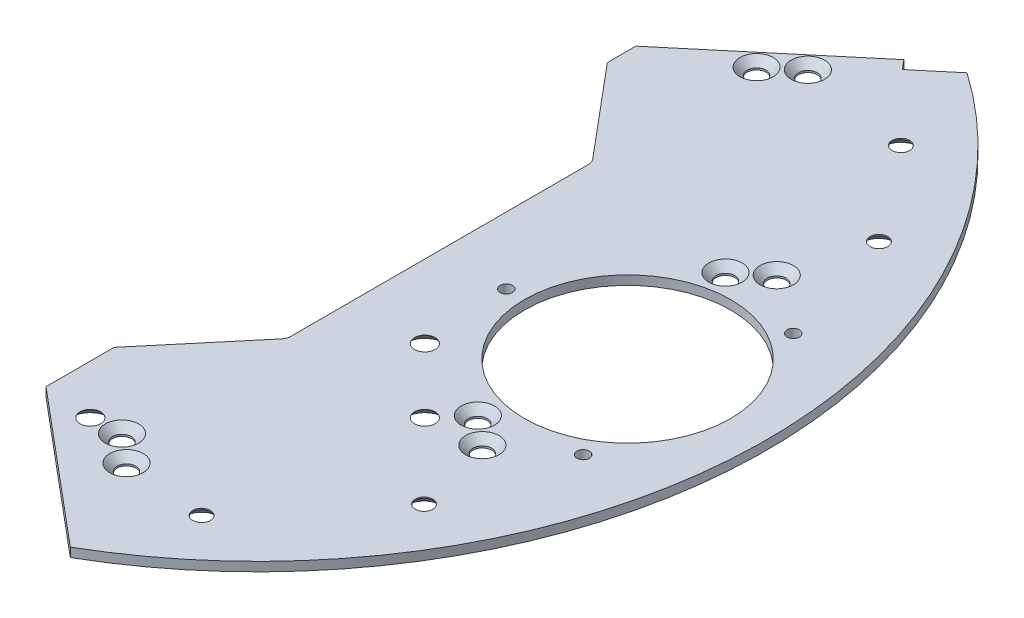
ISO-10303-21;
HEADER;
FILE_DESCRIPTION(('STEP AP214'),'2;1');
FILE_NAME('part.step','',(''),(''),'','','');
FILE_SCHEMA(('AUTOMOTIVE_DESIGN { 1 0 10303 214 1 1 1 1 }'));
ENDSEC;
DATA;
#1=APPLICATION_CONTEXT('core data for automotive mechanical design processes');
#2=APPLICATION_PROTOCOL_DEFINITION('international standard','automotive_design',2000,#1);
#3=PRODUCT_CONTEXT('',#1,'mechanical');
#4=PRODUCT('Part','Part','',(#3));
#5=PRODUCT_RELATED_PRODUCT_CATEGORY('part','',(#4));
#6=PRODUCT_DEFINITION_FORMATION('','',#4);
#7=PRODUCT_DEFINITION_CONTEXT('part definition',#1,'design');
#8=PRODUCT_DEFINITION('design','',#6,#7);
#9=PRODUCT_DEFINITION_SHAPE('','',#8);
#10=(LENGTH_UNIT() NAMED_UNIT(*) SI_UNIT(.MILLI.,.METRE.));
#11=(NAMED_UNIT(*) PLANE_ANGLE_UNIT() SI_UNIT($,.RADIAN.));
#12=(NAMED_UNIT(*) SI_UNIT($,.STERADIAN.) SOLID_ANGLE_UNIT());
#13=UNCERTAINTY_MEASURE_WITH_UNIT(LENGTH_MEASURE(1.E-05),#10,'distance_accuracy_value','');
#14=(GEOMETRIC_REPRESENTATION_CONTEXT(3) GLOBAL_UNCERTAINTY_ASSIGNED_CONTEXT((#13)) GLOBAL_UNIT_ASSIGNED_CONTEXT((#10,
#11,#12)) REPRESENTATION_CONTEXT('',''));
#15=CARTESIAN_POINT('',(0.,0.,0.));
#16=DIRECTION('',(0.,0.,1.));
#17=DIRECTION('',(1.,0.,0.));
#18=AXIS2_PLACEMENT_3D('',#15,#16,#17);
#19=CARTESIAN_POINT('',(17.,1.5,85.3229160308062));
#20=DIRECTION('',(-1.,0.,0.));
#21=DIRECTION('',(0.,0.,1.));
#22=AXIS2_PLACEMENT_3D('',#19,#20,#21);
#23=PLANE('',#22);
#24=DIRECTION('',(0.,1.,0.));
#25=VECTOR('',#24,1.);
#26=CARTESIAN_POINT('',(17.,0.,51.8930588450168));
#27=LINE('',#26,#25);
#28=CARTESIAN_POINT('',(17.,0.,51.8930588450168));
#29=VERTEX_POINT('',#28);
#30=CARTESIAN_POINT('',(17.,1.5,51.8930588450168));
#31=VERTEX_POINT('',#30);
#32=EDGE_CURVE('E155',#29,#31,#27,.T.);
#33=ORIENTED_EDGE('',*,*,#32,.T.);
#34=DIRECTION('',(0.,0.,-1.));
#35=VECTOR('',#34,1.);
#36=CARTESIAN_POINT('',(17.,1.5,85.3229160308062));
#37=LINE('',#36,#35);
#38=CARTESIAN_POINT('',(17.,1.5,40.6657856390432));
#39=VERTEX_POINT('',#38);
#40=EDGE_CURVE('E337',#31,#39,#37,.T.);
#41=ORIENTED_EDGE('',*,*,#40,.T.);
#42=DIRECTION('',(0.,1.,0.));
#43=VECTOR('',#42,1.);
#44=CARTESIAN_POINT('',(17.,-1.,40.6657856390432));
#45=LINE('',#44,#43);
#46=CARTESIAN_POINT('',(17.,0.,40.6657856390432));
#47=VERTEX_POINT('',#46);
#48=EDGE_CURVE('E305',#47,#39,#45,.T.);
#49=ORIENTED_EDGE('',*,*,#48,.F.);
#50=DIRECTION('',(0.,0.,-1.));
#51=VECTOR('',#50,1.);
#52=CARTESIAN_POINT('',(17.,0.,85.3229160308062));
#53=LINE('',#52,#51);
#54=EDGE_CURVE('E341',#29,#47,#53,.T.);
#55=ORIENTED_EDGE('',*,*,#54,.F.);
#56=EDGE_LOOP('',(#33,#41,#49,#55));
#57=FACE_BOUND('',#56,.T.);
#58=ADVANCED_FACE('F40',(#57),#23,.T.);
#59=DIRECTION('',(0.,-1.,0.));
#60=VECTOR('',#59,1.);
#61=CARTESIAN_POINT('',(17.,1.5,-45.3660223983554));
#62=LINE('',#61,#60);
#63=CARTESIAN_POINT('',(17.,1.5,-45.3660223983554));
#64=VERTEX_POINT('',#63);
#65=CARTESIAN_POINT('',(17.,0.,-45.3660223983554));
#66=VERTEX_POINT('',#65);
#67=EDGE_CURVE('E157',#64,#66,#62,.T.);
#68=ORIENTED_EDGE('',*,*,#67,.T.);
#69=CARTESIAN_POINT('',(17.,0.,-40.6657856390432));
#70=VERTEX_POINT('',#69);
#71=EDGE_CURVE('E154',#70,#66,#53,.T.);
#72=ORIENTED_EDGE('',*,*,#71,.F.);
#73=DIRECTION('',(0.,1.,0.));
#74=VECTOR('',#73,1.);
#75=CARTESIAN_POINT('',(17.,-1.,-40.6657856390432));
#76=LINE('',#75,#74);
#77=CARTESIAN_POINT('',(17.,1.5,-40.6657856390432));
#78=VERTEX_POINT('',#77);
#79=EDGE_CURVE('E308',#70,#78,#76,.T.);
#80=ORIENTED_EDGE('',*,*,#79,.T.);
#81=EDGE_CURVE('E340',#78,#64,#37,.T.);
#82=ORIENTED_EDGE('',*,*,#81,.T.);
#83=EDGE_LOOP('',(#68,#72,#80,#82));
#84=FACE_BOUND('',#83,.T.);
#85=ADVANCED_FACE('F42',(#84),#23,.T.);
#86=CARTESIAN_POINT('',(0.,1.5,0.));
#87=DIRECTION('',(0.,1.,0.));
#88=DIRECTION('',(0.,0.,1.));
#89=AXIS2_PLACEMENT_3D('',#86,#87,#88);
#90=PLANE('',#89);
#91=DIRECTION('',(0.766044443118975,0.,-0.642787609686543));
#92=VECTOR('',#91,1.);
#93=CARTESIAN_POINT('',(42.3140472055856,1.5,-63.9962154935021));
#94=LINE('',#93,#92);
#95=CARTESIAN_POINT('',(42.3140472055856,1.5,-63.9962154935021));
#96=VERTEX_POINT('',#95);
#97=CARTESIAN_POINT('',(48.108978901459,1.5,-68.858740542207));
#98=VERTEX_POINT('',#97);
#99=EDGE_CURVE('E55',#96,#98,#94,.T.);
#100=ORIENTED_EDGE('',*,*,#99,.F.);
#101=DIRECTION('',(0.642787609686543,0.,0.766044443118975));
#102=VECTOR('',#101,1.);
#103=CARTESIAN_POINT('',(41.0284719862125,1.5,-65.52830437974));
#104=LINE('',#103,#102);
#105=CARTESIAN_POINT('',(41.0284719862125,1.5,-65.52830437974));
#106=VERTEX_POINT('',#105);
#107=EDGE_CURVE('E460',#106,#96,#104,.T.);
#108=ORIENTED_EDGE('',*,*,#107,.F.);
#109=DIRECTION('',(-0.766044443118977,0.,0.642787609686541));
#110=VECTOR('',#109,1.);
#111=CARTESIAN_POINT('',(28.0276438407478,1.5,-54.6193142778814));
#112=LINE('',#111,#110);
#113=EDGE_CURVE('E147',#106,#64,#112,.T.);
#114=ORIENTED_EDGE('',*,*,#113,.T.);
#115=ORIENTED_EDGE('',*,*,#81,.F.);
#116=DIRECTION('',(-0.642787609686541,0.,-0.766044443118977));
#117=VECTOR('',#116,1.);
#118=CARTESIAN_POINT('',(29.5320888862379,1.5,-25.7306236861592));
#119=LINE('',#118,#117);
#120=CARTESIAN_POINT('',(29.5320888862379,1.5,-25.7306236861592));
#121=VERTEX_POINT('',#120);
#122=EDGE_CURVE('E291',#121,#78,#119,.T.);
#123=ORIENTED_EDGE('',*,*,#122,.F.);
#124=CARTESIAN_POINT('',(28.,1.5,-24.4450484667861));
#125=DIRECTION('',(0.,1.,0.));
#126=DIRECTION('',(0.,0.,1.));
#127=AXIS2_PLACEMENT_3D('',#124,#125,#126);
#128=CIRCLE('',#127,2.);
#129=CARTESIAN_POINT('',(30.,1.5,-24.4450484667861));
#130=VERTEX_POINT('',#129);
#131=EDGE_CURVE('E288',#130,#121,#128,.T.);
#132=ORIENTED_EDGE('',*,*,#131,.F.);
#133=DIRECTION('',(0.,0.,-1.));
#134=VECTOR('',#133,1.);
#135=CARTESIAN_POINT('',(30.,1.5,0.));
#136=LINE('',#135,#134);
#137=CARTESIAN_POINT('',(30.,1.5,24.4450484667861));
#138=VERTEX_POINT('',#137);
#139=EDGE_CURVE('E285',#138,#130,#136,.T.);
#140=ORIENTED_EDGE('',*,*,#139,.F.);
#141=CARTESIAN_POINT('',(28.,1.5,24.4450484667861));
#142=DIRECTION('',(0.,1.,0.));
#143=DIRECTION('',(0.,0.,-1.));
#144=AXIS2_PLACEMENT_3D('',#141,#142,#143);
#145=CIRCLE('',#144,2.);
#146=CARTESIAN_POINT('',(29.532088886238,1.5,25.7306236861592));
#147=VERTEX_POINT('',#146);
#148=EDGE_CURVE('E296',#147,#138,#145,.T.);
#149=ORIENTED_EDGE('',*,*,#148,.F.);
#150=DIRECTION('',(0.64278760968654,0.,-0.766044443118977));
#151=VECTOR('',#150,1.);
#152=CARTESIAN_POINT('',(29.532088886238,1.5,25.7306236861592));
#153=LINE('',#152,#151);
#154=EDGE_CURVE('E293',#39,#147,#153,.T.);
#155=ORIENTED_EDGE('',*,*,#154,.F.);
#156=ORIENTED_EDGE('',*,*,#40,.F.);
#157=DIRECTION('',(-0.766044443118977,0.,-0.642787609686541));
#158=VECTOR('',#157,1.);
#159=CARTESIAN_POINT('',(24.8137057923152,1.5,58.4495364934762));
#160=LINE('',#159,#158);
#161=CARTESIAN_POINT('',(41.9121137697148,1.5,72.796804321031));
#162=VERTEX_POINT('',#161);
#163=EDGE_CURVE('E160',#162,#31,#160,.T.);
#164=ORIENTED_EDGE('',*,*,#163,.F.);
#165=CARTESIAN_POINT('',(0.,1.5,0.));
#166=DIRECTION('',(0.,-1.,0.));
#167=DIRECTION('',(0.,0.,-1.));
#168=AXIS2_PLACEMENT_3D('',#165,#166,#167);
#169=CIRCLE('',#168,84.);
#170=EDGE_CURVE('E62',#98,#162,#169,.T.);
#171=ORIENTED_EDGE('',*,*,#170,.F.);
#172=EDGE_LOOP('',(#100,#108,#114,#115,#123,#132,#140,#149,#155,#156,#164,#171));
#173=FACE_BOUND('',#172,.T.);
#174=CARTESIAN_POINT('',(42.0728534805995,1.5,14.4956890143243));
#175=DIRECTION('',(0.,1.,0.));
#176=DIRECTION('',(0.,0.,1.));
#177=AXIS2_PLACEMENT_3D('',#174,#175,#176);
#178=CIRCLE('',#177,1.7);
#179=CARTESIAN_POINT('',(42.0728534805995,1.5,16.1956890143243));
#180=VERTEX_POINT('',#179);
#181=EDGE_CURVE('E170',#180,#180,#178,.T.);
#182=ORIENTED_EDGE('',*,*,#181,.F.);
#183=EDGE_LOOP('',(#182));
#184=FACE_BOUND('',#183,.T.);
#185=CARTESIAN_POINT('',(52.6794551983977,1.5,25.1022907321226));
#186=DIRECTION('',(0.,1.,0.));
#187=DIRECTION('',(0.,0.,1.));
#188=AXIS2_PLACEMENT_3D('',#185,#186,#187);
#189=CIRCLE('',#188,1.7);
#190=CARTESIAN_POINT('',(52.6794551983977,1.5,26.8022907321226));
#191=VERTEX_POINT('',#190);
#192=EDGE_CURVE('E177',#191,#191,#189,.T.);
#193=ORIENTED_EDGE('',*,*,#192,.F.);
#194=EDGE_LOOP('',(#193));
#195=FACE_BOUND('',#194,.T.);
#196=CARTESIAN_POINT('',(25.1022907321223,1.5,52.6794551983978));
#197=DIRECTION('',(0.,1.,0.));
#198=DIRECTION('',(0.,0.,1.));
#199=AXIS2_PLACEMENT_3D('',#196,#197,#198);
#200=CIRCLE('',#199,1.7);
#201=CARTESIAN_POINT('',(25.1022907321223,1.5,54.3794551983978));
#202=VERTEX_POINT('',#201);
#203=EDGE_CURVE('E184',#202,#202,#200,.T.);
#204=ORIENTED_EDGE('',*,*,#203,.F.);
#205=EDGE_LOOP('',(#204));
#206=FACE_BOUND('',#205,.T.);
#207=CARTESIAN_POINT('',(48.2090707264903,1.5,57.4533332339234));
#208=DIRECTION('',(0.,1.,0.));
#209=DIRECTION('',(0.,0.,1.));
#210=AXIS2_PLACEMENT_3D('',#207,#208,#209);
#211=CIRCLE('',#210,1.44999999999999);
#212=CARTESIAN_POINT('',(48.2090707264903,1.5,58.9033332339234));
#213=VERTEX_POINT('',#212);
#214=EDGE_CURVE('E191',#213,#213,#211,.T.);
#215=ORIENTED_EDGE('',*,*,#214,.F.);
#216=EDGE_LOOP('',(#215));
#217=FACE_BOUND('',#216,.T.);
#218=CARTESIAN_POINT('',(64.9519052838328,1.5,37.5000000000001));
#219=DIRECTION('',(0.,1.,0.));
#220=DIRECTION('',(0.,0.,1.));
#221=AXIS2_PLACEMENT_3D('',#218,#219,#220);
#222=CIRCLE('',#221,1.44999999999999);
#223=CARTESIAN_POINT('',(64.9519052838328,1.5,38.9500000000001));
#224=VERTEX_POINT('',#223);
#225=EDGE_CURVE('E198',#224,#224,#222,.T.);
#226=ORIENTED_EDGE('',*,*,#225,.F.);
#227=EDGE_LOOP('',(#226));
#228=FACE_BOUND('',#227,.T.);
#229=CARTESIAN_POINT('',(64.9519052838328,1.5,-37.5000000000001));
#230=DIRECTION('',(0.,1.,0.));
#231=DIRECTION('',(0.,0.,1.));
#232=AXIS2_PLACEMENT_3D('',#229,#230,#231);
#233=CIRCLE('',#232,1.44999999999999);
#234=CARTESIAN_POINT('',(64.9519052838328,1.5,-36.0500000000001));
#235=VERTEX_POINT('',#234);
#236=EDGE_CURVE('E205',#235,#235,#233,.T.);
#237=ORIENTED_EDGE('',*,*,#236,.F.);
#238=EDGE_LOOP('',(#237));
#239=FACE_BOUND('',#238,.T.);
#240=CARTESIAN_POINT('',(53.033008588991,1.5,-53.0330085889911));
#241=DIRECTION('',(0.,1.,0.));
#242=DIRECTION('',(0.,0.,1.));
#243=AXIS2_PLACEMENT_3D('',#240,#241,#242);
#244=CIRCLE('',#243,1.44999999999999);
#245=CARTESIAN_POINT('',(53.033008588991,1.5,-51.5830085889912));
#246=VERTEX_POINT('',#245);
#247=EDGE_CURVE('E212',#246,#246,#244,.T.);
#248=ORIENTED_EDGE('',*,*,#247,.F.);
#249=EDGE_LOOP('',(#248));
#250=FACE_BOUND('',#249,.T.);
#251=CARTESIAN_POINT('',(56.7281106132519,1.5,20.415429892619));
#252=DIRECTION('',(0.,1.,0.));
#253=DIRECTION('',(0.,0.,1.));
#254=AXIS2_PLACEMENT_3D('',#251,#252,#253);
#255=CIRCLE('',#254,2.75);
#256=CARTESIAN_POINT('',(56.7281106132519,1.5,23.165429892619));
#257=VERTEX_POINT('',#256);
#258=EDGE_CURVE('E213',#257,#257,#255,.T.);
#259=ORIENTED_EDGE('',*,*,#258,.F.);
#260=EDGE_LOOP('',(#259));
#261=FACE_BOUND('',#260,.T.);
#262=CARTESIAN_POINT('',(61.3243772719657,1.5,24.2721555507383));
#263=DIRECTION('',(0.,1.,0.));
#264=DIRECTION('',(0.,0.,1.));
#265=AXIS2_PLACEMENT_3D('',#262,#263,#264);
#266=CIRCLE('',#265,2.75);
#267=CARTESIAN_POINT('',(61.3243772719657,1.5,27.0221555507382));
#268=VERTEX_POINT('',#267);
#269=EDGE_CURVE('E222',#268,#268,#266,.T.);
#270=ORIENTED_EDGE('',*,*,#269,.F.);
#271=EDGE_LOOP('',(#270));
#272=FACE_BOUND('',#271,.T.);
#273=CARTESIAN_POINT('',(29.9560066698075,1.5,52.3211809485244));
#274=DIRECTION('',(0.,1.,0.));
#275=DIRECTION('',(0.,0.,1.));
#276=AXIS2_PLACEMENT_3D('',#273,#274,#275);
#277=CIRCLE('',#276,2.75);
#278=CARTESIAN_POINT('',(29.9560066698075,1.5,55.0711809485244));
#279=VERTEX_POINT('',#278);
#280=EDGE_CURVE('E231',#279,#279,#277,.T.);
#281=ORIENTED_EDGE('',*,*,#280,.F.);
#282=EDGE_LOOP('',(#281));
#283=FACE_BOUND('',#282,.T.);
#284=CARTESIAN_POINT('',(34.5522733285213,1.5,56.1779066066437));
#285=DIRECTION('',(0.,1.,0.));
#286=DIRECTION('',(0.,0.,1.));
#287=AXIS2_PLACEMENT_3D('',#284,#285,#286);
#288=CIRCLE('',#287,2.75);
#289=CARTESIAN_POINT('',(34.5522733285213,1.5,58.9279066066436));
#290=VERTEX_POINT('',#289);
#291=EDGE_CURVE('E240',#290,#290,#288,.T.);
#292=ORIENTED_EDGE('',*,*,#291,.F.);
#293=EDGE_LOOP('',(#292));
#294=FACE_BOUND('',#293,.T.);
#295=CARTESIAN_POINT('',(34.5522733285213,1.5,-56.1779066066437));
#296=DIRECTION('',(0.,1.,0.));
#297=DIRECTION('',(0.,0.,1.));
#298=AXIS2_PLACEMENT_3D('',#295,#296,#297);
#299=CIRCLE('',#298,2.75);
#300=CARTESIAN_POINT('',(34.5522733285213,1.5,-53.4279066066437));
#301=VERTEX_POINT('',#300);
#302=EDGE_CURVE('E249',#301,#301,#299,.T.);
#303=ORIENTED_EDGE('',*,*,#302,.F.);
#304=EDGE_LOOP('',(#303));
#305=FACE_BOUND('',#304,.T.);
#306=CARTESIAN_POINT('',(29.9560066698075,1.5,-52.3211809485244));
#307=DIRECTION('',(0.,1.,0.));
#308=DIRECTION('',(0.,0.,1.));
#309=AXIS2_PLACEMENT_3D('',#306,#307,#308);
#310=CIRCLE('',#309,2.75);
#311=CARTESIAN_POINT('',(29.9560066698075,1.5,-49.5711809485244));
#312=VERTEX_POINT('',#311);
#313=EDGE_CURVE('E258',#312,#312,#310,.T.);
#314=ORIENTED_EDGE('',*,*,#313,.F.);
#315=EDGE_LOOP('',(#314));
#316=FACE_BOUND('',#315,.T.);
#317=CARTESIAN_POINT('',(61.3243772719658,1.5,-24.2721555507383));
#318=DIRECTION('',(0.,1.,0.));
#319=DIRECTION('',(0.,0.,1.));
#320=AXIS2_PLACEMENT_3D('',#317,#318,#319);
#321=CIRCLE('',#320,2.75);
#322=CARTESIAN_POINT('',(61.3243772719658,1.5,-21.5221555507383));
#323=VERTEX_POINT('',#322);
#324=EDGE_CURVE('E267',#323,#323,#321,.T.);
#325=ORIENTED_EDGE('',*,*,#324,.F.);
#326=EDGE_LOOP('',(#325));
#327=FACE_BOUND('',#326,.T.);
#328=CARTESIAN_POINT('',(56.7281106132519,1.5,-20.4154298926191));
#329=DIRECTION('',(0.,1.,0.));
#330=DIRECTION('',(0.,0.,1.));
#331=AXIS2_PLACEMENT_3D('',#328,#329,#330);
#332=CIRCLE('',#331,2.75);
#333=CARTESIAN_POINT('',(56.7281106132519,1.5,-17.6654298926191));
#334=VERTEX_POINT('',#333);
#335=EDGE_CURVE('E276',#334,#334,#332,.T.);
#336=ORIENTED_EDGE('',*,*,#335,.F.);
#337=EDGE_LOOP('',(#336));
#338=FACE_BOUND('',#337,.T.);
#339=CARTESIAN_POINT('',(71.,1.5,17.3205080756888));
#340=DIRECTION('',(0.,1.,0.));
#341=DIRECTION('',(0.,0.,1.));
#342=AXIS2_PLACEMENT_3D('',#339,#340,#341);
#343=CIRCLE('',#342,1.025);
#344=CARTESIAN_POINT('',(71.,1.5,18.3455080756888));
#345=VERTEX_POINT('',#344);
#346=EDGE_CURVE('E302',#345,#345,#343,.T.);
#347=ORIENTED_EDGE('',*,*,#346,.F.);
#348=EDGE_LOOP('',(#347));
#349=FACE_BOUND('',#348,.T.);
#350=CARTESIAN_POINT('',(41.,1.5,0.));
#351=DIRECTION('',(0.,1.,0.));
#352=DIRECTION('',(0.,0.,1.));
#353=AXIS2_PLACEMENT_3D('',#350,#351,#352);
#354=CIRCLE('',#353,1.025);
#355=CARTESIAN_POINT('',(41.,1.5,1.025));
#356=VERTEX_POINT('',#355);
#357=EDGE_CURVE('E319',#356,#356,#354,.T.);
#358=ORIENTED_EDGE('',*,*,#357,.F.);
#359=EDGE_LOOP('',(#358));
#360=FACE_BOUND('',#359,.T.);
#361=CARTESIAN_POINT('',(71.,1.5,-17.3205080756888));
#362=DIRECTION('',(0.,1.,0.));
#363=DIRECTION('',(0.,0.,1.));
#364=AXIS2_PLACEMENT_3D('',#361,#362,#363);
#365=CIRCLE('',#364,1.025);
#366=CARTESIAN_POINT('',(71.,1.5,-16.2955080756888));
#367=VERTEX_POINT('',#366);
#368=EDGE_CURVE('E325',#367,#367,#365,.T.);
#369=ORIENTED_EDGE('',*,*,#368,.F.);
#370=EDGE_LOOP('',(#369));
#371=FACE_BOUND('',#370,.T.);
#372=CARTESIAN_POINT('',(61.,1.5,0.));
#373=DIRECTION('',(0.,1.,0.));
#374=DIRECTION('',(0.,0.,1.));
#375=AXIS2_PLACEMENT_3D('',#372,#373,#374);
#376=CIRCLE('',#375,17.);
#377=CARTESIAN_POINT('',(61.,1.5,17.));
#378=VERTEX_POINT('',#377);
#379=EDGE_CURVE('E331',#378,#378,#376,.T.);
#380=ORIENTED_EDGE('',*,*,#379,.F.);
#381=EDGE_LOOP('',(#380));
#382=FACE_BOUND('',#381,.T.);
#383=ADVANCED_FACE('F372',(#173,#184,#195,#206,#217,#228,#239,#250,#261,#272,#283,#294,#305,
#316,#327,#338,#349,#360,#371,#382),#90,.T.);
#384=CARTESIAN_POINT('',(0.,0.,0.));
#385=DIRECTION('',(0.,1.,0.));
#386=DIRECTION('',(0.,0.,1.));
#387=AXIS2_PLACEMENT_3D('',#384,#385,#386);
#388=PLANE('',#387);
#389=CARTESIAN_POINT('',(42.0728534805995,0.,14.4956890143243));
#390=DIRECTION('',(0.,-1.,0.));
#391=DIRECTION('',(0.,0.,-1.));
#392=AXIS2_PLACEMENT_3D('',#389,#390,#391);
#393=CIRCLE('',#392,3.15);
#394=CARTESIAN_POINT('',(42.0728534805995,0.,11.3456890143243));
#395=VERTEX_POINT('',#394);
#396=EDGE_CURVE('E164',#395,#395,#393,.T.);
#397=ORIENTED_EDGE('',*,*,#396,.F.);
#398=EDGE_LOOP('',(#397));
#399=FACE_BOUND('',#398,.T.);
#400=CARTESIAN_POINT('',(52.6794551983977,0.,25.1022907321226));
#401=DIRECTION('',(0.,-1.,0.));
#402=DIRECTION('',(0.,0.,-1.));
#403=AXIS2_PLACEMENT_3D('',#400,#401,#402);
#404=CIRCLE('',#403,3.15);
#405=CARTESIAN_POINT('',(52.6794551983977,0.,21.9522907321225));
#406=VERTEX_POINT('',#405);
#407=EDGE_CURVE('E171',#406,#406,#404,.T.);
#408=ORIENTED_EDGE('',*,*,#407,.F.);
#409=EDGE_LOOP('',(#408));
#410=FACE_BOUND('',#409,.T.);
#411=CARTESIAN_POINT('',(25.1022907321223,0.,52.6794551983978));
#412=DIRECTION('',(0.,-1.,0.));
#413=DIRECTION('',(0.,0.,-1.));
#414=AXIS2_PLACEMENT_3D('',#411,#412,#413);
#415=CIRCLE('',#414,3.15);
#416=CARTESIAN_POINT('',(25.1022907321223,0.,49.5294551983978));
#417=VERTEX_POINT('',#416);
#418=EDGE_CURVE('E178',#417,#417,#415,.T.);
#419=ORIENTED_EDGE('',*,*,#418,.F.);
#420=EDGE_LOOP('',(#419));
#421=FACE_BOUND('',#420,.T.);
#422=CARTESIAN_POINT('',(48.2090707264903,0.,57.4533332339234));
#423=DIRECTION('',(0.,-1.,0.));
#424=DIRECTION('',(0.,0.,-1.));
#425=AXIS2_PLACEMENT_3D('',#422,#423,#424);
#426=CIRCLE('',#425,2.75);
#427=CARTESIAN_POINT('',(48.2090707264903,0.,54.7033332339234));
#428=VERTEX_POINT('',#427);
#429=EDGE_CURVE('E185',#428,#428,#426,.T.);
#430=ORIENTED_EDGE('',*,*,#429,.F.);
#431=EDGE_LOOP('',(#430));
#432=FACE_BOUND('',#431,.T.);
#433=CARTESIAN_POINT('',(64.9519052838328,0.,37.5000000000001));
#434=DIRECTION('',(0.,-1.,0.));
#435=DIRECTION('',(0.,0.,-1.));
#436=AXIS2_PLACEMENT_3D('',#433,#434,#435);
#437=CIRCLE('',#436,2.75);
#438=CARTESIAN_POINT('',(64.9519052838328,0.,34.7500000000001));
#439=VERTEX_POINT('',#438);
#440=EDGE_CURVE('E192',#439,#439,#437,.T.);
#441=ORIENTED_EDGE('',*,*,#440,.F.);
#442=EDGE_LOOP('',(#441));
#443=FACE_BOUND('',#442,.T.);
#444=CARTESIAN_POINT('',(64.9519052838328,0.,-37.5000000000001));
#445=DIRECTION('',(0.,-1.,0.));
#446=DIRECTION('',(0.,0.,-1.));
#447=AXIS2_PLACEMENT_3D('',#444,#445,#446);
#448=CIRCLE('',#447,2.75);
#449=CARTESIAN_POINT('',(64.9519052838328,0.,-40.2500000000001));
#450=VERTEX_POINT('',#449);
#451=EDGE_CURVE('E199',#450,#450,#448,.T.);
#452=ORIENTED_EDGE('',*,*,#451,.F.);
#453=EDGE_LOOP('',(#452));
#454=FACE_BOUND('',#453,.T.);
#455=CARTESIAN_POINT('',(53.033008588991,0.,-53.0330085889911));
#456=DIRECTION('',(0.,-1.,0.));
#457=DIRECTION('',(0.,0.,-1.));
#458=AXIS2_PLACEMENT_3D('',#455,#456,#457);
#459=CIRCLE('',#458,2.75);
#460=CARTESIAN_POINT('',(53.033008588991,0.,-55.7830085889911));
#461=VERTEX_POINT('',#460);
#462=EDGE_CURVE('E206',#461,#461,#459,.T.);
#463=ORIENTED_EDGE('',*,*,#462,.F.);
#464=EDGE_LOOP('',(#463));
#465=FACE_BOUND('',#464,.T.);
#466=CARTESIAN_POINT('',(56.7281106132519,0.,20.415429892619));
#467=DIRECTION('',(0.,1.,0.));
#468=DIRECTION('',(0.,0.,1.));
#469=AXIS2_PLACEMENT_3D('',#466,#467,#468);
#470=CIRCLE('',#469,1.55);
#471=CARTESIAN_POINT('',(56.7281106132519,0.,21.965429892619));
#472=VERTEX_POINT('',#471);
#473=EDGE_CURVE('E219',#472,#472,#470,.T.);
#474=ORIENTED_EDGE('',*,*,#473,.T.);
#475=EDGE_LOOP('',(#474));
#476=FACE_BOUND('',#475,.T.);
#477=CARTESIAN_POINT('',(61.3243772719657,0.,24.2721555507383));
#478=DIRECTION('',(0.,1.,0.));
#479=DIRECTION('',(0.,0.,1.));
#480=AXIS2_PLACEMENT_3D('',#477,#478,#479);
#481=CIRCLE('',#480,1.55);
#482=CARTESIAN_POINT('',(61.3243772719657,0.,25.8221555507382));
#483=VERTEX_POINT('',#482);
#484=EDGE_CURVE('E228',#483,#483,#481,.T.);
#485=ORIENTED_EDGE('',*,*,#484,.T.);
#486=EDGE_LOOP('',(#485));
#487=FACE_BOUND('',#486,.T.);
#488=CARTESIAN_POINT('',(29.9560066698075,0.,52.3211809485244));
#489=DIRECTION('',(0.,1.,0.));
#490=DIRECTION('',(0.,0.,1.));
#491=AXIS2_PLACEMENT_3D('',#488,#489,#490);
#492=CIRCLE('',#491,1.55);
#493=CARTESIAN_POINT('',(29.9560066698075,0.,53.8711809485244));
#494=VERTEX_POINT('',#493);
#495=EDGE_CURVE('E237',#494,#494,#492,.T.);
#496=ORIENTED_EDGE('',*,*,#495,.T.);
#497=EDGE_LOOP('',(#496));
#498=FACE_BOUND('',#497,.T.);
#499=CARTESIAN_POINT('',(34.5522733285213,0.,56.1779066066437));
#500=DIRECTION('',(0.,1.,0.));
#501=DIRECTION('',(0.,0.,1.));
#502=AXIS2_PLACEMENT_3D('',#499,#500,#501);
#503=CIRCLE('',#502,1.55);
#504=CARTESIAN_POINT('',(34.5522733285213,0.,57.7279066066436));
#505=VERTEX_POINT('',#504);
#506=EDGE_CURVE('E246',#505,#505,#503,.T.);
#507=ORIENTED_EDGE('',*,*,#506,.T.);
#508=EDGE_LOOP('',(#507));
#509=FACE_BOUND('',#508,.T.);
#510=CARTESIAN_POINT('',(34.5522733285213,0.,-56.1779066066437));
#511=DIRECTION('',(0.,1.,0.));
#512=DIRECTION('',(0.,0.,1.));
#513=AXIS2_PLACEMENT_3D('',#510,#511,#512);
#514=CIRCLE('',#513,1.55);
#515=CARTESIAN_POINT('',(34.5522733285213,0.,-54.6279066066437));
#516=VERTEX_POINT('',#515);
#517=EDGE_CURVE('E255',#516,#516,#514,.T.);
#518=ORIENTED_EDGE('',*,*,#517,.T.);
#519=EDGE_LOOP('',(#518));
#520=FACE_BOUND('',#519,.T.);
#521=CARTESIAN_POINT('',(29.9560066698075,0.,-52.3211809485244));
#522=DIRECTION('',(0.,1.,0.));
#523=DIRECTION('',(0.,0.,1.));
#524=AXIS2_PLACEMENT_3D('',#521,#522,#523);
#525=CIRCLE('',#524,1.55);
#526=CARTESIAN_POINT('',(29.9560066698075,0.,-50.7711809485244));
#527=VERTEX_POINT('',#526);
#528=EDGE_CURVE('E264',#527,#527,#525,.T.);
#529=ORIENTED_EDGE('',*,*,#528,.T.);
#530=EDGE_LOOP('',(#529));
#531=FACE_BOUND('',#530,.T.);
#532=CARTESIAN_POINT('',(61.3243772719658,0.,-24.2721555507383));
#533=DIRECTION('',(0.,1.,0.));
#534=DIRECTION('',(0.,0.,1.));
#535=AXIS2_PLACEMENT_3D('',#532,#533,#534);
#536=CIRCLE('',#535,1.55);
#537=CARTESIAN_POINT('',(61.3243772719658,0.,-22.7221555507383));
#538=VERTEX_POINT('',#537);
#539=EDGE_CURVE('E273',#538,#538,#536,.T.);
#540=ORIENTED_EDGE('',*,*,#539,.T.);
#541=EDGE_LOOP('',(#540));
#542=FACE_BOUND('',#541,.T.);
#543=CARTESIAN_POINT('',(56.7281106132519,0.,-20.4154298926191));
#544=DIRECTION('',(0.,1.,0.));
#545=DIRECTION('',(0.,0.,1.));
#546=AXIS2_PLACEMENT_3D('',#543,#544,#545);
#547=CIRCLE('',#546,1.55);
#548=CARTESIAN_POINT('',(56.7281106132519,0.,-18.8654298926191));
#549=VERTEX_POINT('',#548);
#550=EDGE_CURVE('E282',#549,#549,#547,.T.);
#551=ORIENTED_EDGE('',*,*,#550,.T.);
#552=EDGE_LOOP('',(#551));
#553=FACE_BOUND('',#552,.T.);
#554=DIRECTION('',(0.642787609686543,0.,0.766044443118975));
#555=VECTOR('',#554,1.);
#556=CARTESIAN_POINT('',(41.0284719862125,0.,-65.52830437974));
#557=LINE('',#556,#555);
#558=CARTESIAN_POINT('',(41.0284719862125,0.,-65.52830437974));
#559=VERTEX_POINT('',#558);
#560=CARTESIAN_POINT('',(42.3140472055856,0.,-63.9962154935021));
#561=VERTEX_POINT('',#560);
#562=EDGE_CURVE('E128',#559,#561,#557,.T.);
#563=ORIENTED_EDGE('',*,*,#562,.T.);
#564=DIRECTION('',(0.766044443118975,0.,-0.642787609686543));
#565=VECTOR('',#564,1.);
#566=CARTESIAN_POINT('',(42.3140472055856,0.,-63.9962154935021));
#567=LINE('',#566,#565);
#568=CARTESIAN_POINT('',(48.108978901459,0.,-68.858740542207));
#569=VERTEX_POINT('',#568);
#570=EDGE_CURVE('E139',#561,#569,#567,.T.);
#571=ORIENTED_EDGE('',*,*,#570,.T.);
#572=CARTESIAN_POINT('',(0.,0.,0.));
#573=DIRECTION('',(0.,-1.,0.));
#574=DIRECTION('',(0.,0.,-1.));
#575=AXIS2_PLACEMENT_3D('',#572,#573,#574);
#576=CIRCLE('',#575,84.);
#577=CARTESIAN_POINT('',(41.9121137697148,0.,72.796804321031));
#578=VERTEX_POINT('',#577);
#579=EDGE_CURVE('E448',#569,#578,#576,.T.);
#580=ORIENTED_EDGE('',*,*,#579,.T.);
#581=DIRECTION('',(-0.766044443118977,0.,-0.642787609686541));
#582=VECTOR('',#581,1.);
#583=CARTESIAN_POINT('',(-18.5283528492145,0.,22.0812310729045));
#584=LINE('',#583,#582);
#585=EDGE_CURVE('E11',#578,#29,#584,.T.);
#586=ORIENTED_EDGE('',*,*,#585,.T.);
#587=ORIENTED_EDGE('',*,*,#54,.T.);
#588=DIRECTION('',(0.64278760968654,0.,-0.766044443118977));
#589=VECTOR('',#588,1.);
#590=CARTESIAN_POINT('',(30.,0.,25.1729889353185));
#591=LINE('',#590,#589);
#592=CARTESIAN_POINT('',(29.532088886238,0.,25.7306236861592));
#593=VERTEX_POINT('',#592);
#594=EDGE_CURVE('E48',#47,#593,#591,.T.);
#595=ORIENTED_EDGE('',*,*,#594,.T.);
#596=CARTESIAN_POINT('',(28.,0.,24.4450484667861));
#597=DIRECTION('',(0.,1.,0.));
#598=DIRECTION('',(0.,0.,1.));
#599=AXIS2_PLACEMENT_3D('',#596,#597,#598);
#600=CIRCLE('',#599,2.);
#601=CARTESIAN_POINT('',(30.,0.,24.4450484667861));
#602=VERTEX_POINT('',#601);
#603=EDGE_CURVE('E350',#593,#602,#600,.T.);
#604=ORIENTED_EDGE('',*,*,#603,.T.);
#605=DIRECTION('',(0.,0.,-1.));
#606=VECTOR('',#605,1.);
#607=CARTESIAN_POINT('',(30.,0.,0.));
#608=LINE('',#607,#606);
#609=CARTESIAN_POINT('',(30.,0.,-24.4450484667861));
#610=VERTEX_POINT('',#609);
#611=EDGE_CURVE('E339',#602,#610,#608,.T.);
#612=ORIENTED_EDGE('',*,*,#611,.T.);
#613=CARTESIAN_POINT('',(28.,0.,-24.4450484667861));
#614=DIRECTION('',(0.,1.,0.));
#615=DIRECTION('',(0.,0.,1.));
#616=AXIS2_PLACEMENT_3D('',#613,#614,#615);
#617=CIRCLE('',#616,2.);
#618=CARTESIAN_POINT('',(29.5320888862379,0.,-25.7306236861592));
#619=VERTEX_POINT('',#618);
#620=EDGE_CURVE('E345',#610,#619,#617,.T.);
#621=ORIENTED_EDGE('',*,*,#620,.T.);
#622=DIRECTION('',(-0.642787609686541,0.,-0.766044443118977));
#623=VECTOR('',#622,1.);
#624=CARTESIAN_POINT('',(30.,0.,-25.1729889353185));
#625=LINE('',#624,#623);
#626=EDGE_CURVE('E348',#619,#70,#625,.T.);
#627=ORIENTED_EDGE('',*,*,#626,.T.);
#628=ORIENTED_EDGE('',*,*,#71,.T.);
#629=DIRECTION('',(-0.766044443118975,0.,0.642787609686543));
#630=VECTOR('',#629,1.);
#631=CARTESIAN_POINT('',(28.0276438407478,0.,-54.6193142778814));
#632=LINE('',#631,#630);
#633=EDGE_CURVE('E145',#559,#66,#632,.T.);
#634=ORIENTED_EDGE('',*,*,#633,.F.);
#635=EDGE_LOOP('',(#563,#571,#580,#586,#587,#595,#604,#612,#621,#627,#628,#634));
#636=FACE_BOUND('',#635,.T.);
#637=CARTESIAN_POINT('',(71.,0.,17.3205080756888));
#638=DIRECTION('',(0.,1.,0.));
#639=DIRECTION('',(0.,0.,1.));
#640=AXIS2_PLACEMENT_3D('',#637,#638,#639);
#641=CIRCLE('',#640,1.025);
#642=CARTESIAN_POINT('',(71.,0.,18.3455080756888));
#643=VERTEX_POINT('',#642);
#644=EDGE_CURVE('E316',#643,#643,#641,.T.);
#645=ORIENTED_EDGE('',*,*,#644,.T.);
#646=EDGE_LOOP('',(#645));
#647=FACE_BOUND('',#646,.T.);
#648=CARTESIAN_POINT('',(41.,0.,0.));
#649=DIRECTION('',(0.,1.,0.));
#650=DIRECTION('',(0.,0.,1.));
#651=AXIS2_PLACEMENT_3D('',#648,#649,#650);
#652=CIRCLE('',#651,1.025);
#653=CARTESIAN_POINT('',(41.,0.,1.025));
#654=VERTEX_POINT('',#653);
#655=EDGE_CURVE('E322',#654,#654,#652,.T.);
#656=ORIENTED_EDGE('',*,*,#655,.T.);
#657=EDGE_LOOP('',(#656));
#658=FACE_BOUND('',#657,.T.);
#659=CARTESIAN_POINT('',(71.,0.,-17.3205080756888));
#660=DIRECTION('',(0.,1.,0.));
#661=DIRECTION('',(0.,0.,1.));
#662=AXIS2_PLACEMENT_3D('',#659,#660,#661);
#663=CIRCLE('',#662,1.025);
#664=CARTESIAN_POINT('',(71.,0.,-16.2955080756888));
#665=VERTEX_POINT('',#664);
#666=EDGE_CURVE('E328',#665,#665,#663,.T.);
#667=ORIENTED_EDGE('',*,*,#666,.T.);
#668=EDGE_LOOP('',(#667));
#669=FACE_BOUND('',#668,.T.);
#670=CARTESIAN_POINT('',(61.,0.,0.));
#671=DIRECTION('',(0.,1.,0.));
#672=DIRECTION('',(0.,0.,1.));
#673=AXIS2_PLACEMENT_3D('',#670,#671,#672);
#674=CIRCLE('',#673,17.);
#675=CARTESIAN_POINT('',(61.,0.,17.));
#676=VERTEX_POINT('',#675);
#677=EDGE_CURVE('E332',#676,#676,#674,.T.);
#678=ORIENTED_EDGE('',*,*,#677,.T.);
#679=EDGE_LOOP('',(#678));
#680=FACE_BOUND('',#679,.T.);
#681=ADVANCED_FACE('F150',(#399,#410,#421,#432,#443,#454,#465,#476,#487,#498,#509,#520,#531,
#542,#553,#636,#647,#658,#669,#680),#388,.F.);
#682=CARTESIAN_POINT('',(61.,0.,0.));
#683=DIRECTION('',(0.,1.,0.));
#684=DIRECTION('',(0.,0.,1.));
#685=AXIS2_PLACEMENT_3D('',#682,#683,#684);
#686=CYLINDRICAL_SURFACE('',#685,17.);
#687=ORIENTED_EDGE('',*,*,#677,.F.);
#688=EDGE_LOOP('',(#687));
#689=FACE_BOUND('',#688,.T.);
#690=ORIENTED_EDGE('',*,*,#379,.T.);
#691=EDGE_LOOP('',(#690));
#692=FACE_BOUND('',#691,.T.);
#693=ADVANCED_FACE('F413',(#689,#692),#686,.F.);
#694=CARTESIAN_POINT('',(71.,1.5,-17.3205080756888));
#695=DIRECTION('',(0.,1.,0.));
#696=DIRECTION('',(0.,0.,1.));
#697=AXIS2_PLACEMENT_3D('',#694,#695,#696);
#698=CYLINDRICAL_SURFACE('',#697,1.025);
#699=ORIENTED_EDGE('',*,*,#666,.F.);
#700=EDGE_LOOP('',(#699));
#701=FACE_BOUND('',#700,.T.);
#702=ORIENTED_EDGE('',*,*,#368,.T.);
#703=EDGE_LOOP('',(#702));
#704=FACE_BOUND('',#703,.T.);
#705=ADVANCED_FACE('F415',(#701,#704),#698,.F.);
#706=CARTESIAN_POINT('',(41.,1.5,0.));
#707=DIRECTION('',(0.,1.,0.));
#708=DIRECTION('',(0.,0.,1.));
#709=AXIS2_PLACEMENT_3D('',#706,#707,#708);
#710=CYLINDRICAL_SURFACE('',#709,1.025);
#711=ORIENTED_EDGE('',*,*,#655,.F.);
#712=EDGE_LOOP('',(#711));
#713=FACE_BOUND('',#712,.T.);
#714=ORIENTED_EDGE('',*,*,#357,.T.);
#715=EDGE_LOOP('',(#714));
#716=FACE_BOUND('',#715,.T.);
#717=ADVANCED_FACE('F422',(#713,#716),#710,.F.);
#718=CARTESIAN_POINT('',(71.,1.5,17.3205080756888));
#719=DIRECTION('',(0.,1.,0.));
#720=DIRECTION('',(0.,0.,1.));
#721=AXIS2_PLACEMENT_3D('',#718,#719,#720);
#722=CYLINDRICAL_SURFACE('',#721,1.025);
#723=ORIENTED_EDGE('',*,*,#644,.F.);
#724=EDGE_LOOP('',(#723));
#725=FACE_BOUND('',#724,.T.);
#726=ORIENTED_EDGE('',*,*,#346,.T.);
#727=EDGE_LOOP('',(#726));
#728=FACE_BOUND('',#727,.T.);
#729=ADVANCED_FACE('F479',(#725,#728),#722,.F.);
#730=CARTESIAN_POINT('',(28.,-1.,24.4450484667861));
#731=DIRECTION('',(0.,1.,0.));
#732=DIRECTION('',(0.,0.,1.));
#733=AXIS2_PLACEMENT_3D('',#730,#731,#732);
#734=CYLINDRICAL_SURFACE('',#733,2.);
#735=DIRECTION('',(0.,1.,0.));
#736=VECTOR('',#735,1.);
#737=CARTESIAN_POINT('',(29.532088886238,-1.,25.7306236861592));
#738=LINE('',#737,#736);
#739=EDGE_CURVE('E303',#593,#147,#738,.T.);
#740=ORIENTED_EDGE('',*,*,#739,.T.);
#741=ORIENTED_EDGE('',*,*,#148,.T.);
#742=DIRECTION('',(0.,1.,0.));
#743=VECTOR('',#742,1.);
#744=CARTESIAN_POINT('',(30.,-1.,24.4450484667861));
#745=LINE('',#744,#743);
#746=EDGE_CURVE('E300',#602,#138,#745,.T.);
#747=ORIENTED_EDGE('',*,*,#746,.F.);
#748=ORIENTED_EDGE('',*,*,#603,.F.);
#749=EDGE_LOOP('',(#740,#741,#747,#748));
#750=FACE_BOUND('',#749,.T.);
#751=ADVANCED_FACE('F477',(#750),#734,.F.);
#752=CARTESIAN_POINT('',(29.532088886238,-1.,25.7306236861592));
#753=DIRECTION('',(0.766044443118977,0.,0.64278760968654));
#754=DIRECTION('',(0.64278760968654,0.,-0.766044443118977));
#755=AXIS2_PLACEMENT_3D('',#752,#753,#754);
#756=PLANE('',#755);
#757=ORIENTED_EDGE('',*,*,#48,.T.);
#758=ORIENTED_EDGE('',*,*,#154,.T.);
#759=ORIENTED_EDGE('',*,*,#739,.F.);
#760=ORIENTED_EDGE('',*,*,#594,.F.);
#761=EDGE_LOOP('',(#757,#758,#759,#760));
#762=FACE_BOUND('',#761,.T.);
#763=ADVANCED_FACE('F445',(#762),#756,.F.);
#764=CARTESIAN_POINT('',(29.5320888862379,-1.,-25.7306236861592));
#765=DIRECTION('',(0.766044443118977,0.,-0.642787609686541));
#766=DIRECTION('',(-0.642787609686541,0.,-0.766044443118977));
#767=AXIS2_PLACEMENT_3D('',#764,#765,#766);
#768=PLANE('',#767);
#769=DIRECTION('',(0.,1.,0.));
#770=VECTOR('',#769,1.);
#771=CARTESIAN_POINT('',(29.5320888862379,-1.,-25.7306236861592));
#772=LINE('',#771,#770);
#773=EDGE_CURVE('E311',#619,#121,#772,.T.);
#774=ORIENTED_EDGE('',*,*,#773,.T.);
#775=ORIENTED_EDGE('',*,*,#122,.T.);
#776=ORIENTED_EDGE('',*,*,#79,.F.);
#777=ORIENTED_EDGE('',*,*,#626,.F.);
#778=EDGE_LOOP('',(#774,#775,#776,#777));
#779=FACE_BOUND('',#778,.T.);
#780=ADVANCED_FACE('F467',(#779),#768,.F.);
#781=CARTESIAN_POINT('',(28.,-1.,-24.4450484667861));
#782=DIRECTION('',(0.,1.,0.));
#783=DIRECTION('',(0.,0.,1.));
#784=AXIS2_PLACEMENT_3D('',#781,#782,#783);
#785=CYLINDRICAL_SURFACE('',#784,2.);
#786=DIRECTION('',(0.,1.,0.));
#787=VECTOR('',#786,1.);
#788=CARTESIAN_POINT('',(30.,-1.,-24.4450484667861));
#789=LINE('',#788,#787);
#790=EDGE_CURVE('E299',#610,#130,#789,.T.);
#791=ORIENTED_EDGE('',*,*,#790,.T.);
#792=ORIENTED_EDGE('',*,*,#131,.T.);
#793=ORIENTED_EDGE('',*,*,#773,.F.);
#794=ORIENTED_EDGE('',*,*,#620,.F.);
#795=EDGE_LOOP('',(#791,#792,#793,#794));
#796=FACE_BOUND('',#795,.T.);
#797=ADVANCED_FACE('F471',(#796),#785,.F.);
#798=CARTESIAN_POINT('',(30.,-1.,0.));
#799=DIRECTION('',(1.,0.,0.));
#800=DIRECTION('',(0.,0.,-1.));
#801=AXIS2_PLACEMENT_3D('',#798,#799,#800);
#802=PLANE('',#801);
#803=ORIENTED_EDGE('',*,*,#746,.T.);
#804=ORIENTED_EDGE('',*,*,#139,.T.);
#805=ORIENTED_EDGE('',*,*,#790,.F.);
#806=ORIENTED_EDGE('',*,*,#611,.F.);
#807=EDGE_LOOP('',(#803,#804,#805,#806));
#808=FACE_BOUND('',#807,.T.);
#809=ADVANCED_FACE('F474',(#808),#802,.F.);
#810=CARTESIAN_POINT('',(56.7281106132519,1.5,-20.4154298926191));
#811=DIRECTION('',(0.,1.,0.));
#812=DIRECTION('',(0.,0.,1.));
#813=AXIS2_PLACEMENT_3D('',#810,#811,#812);
#814=CYLINDRICAL_SURFACE('',#813,1.55);
#815=ORIENTED_EDGE('',*,*,#550,.F.);
#816=EDGE_LOOP('',(#815));
#817=FACE_BOUND('',#816,.T.);
#818=CARTESIAN_POINT('',(56.7281106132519,0.300000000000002,-20.4154298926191));
#819=DIRECTION('',(0.,1.,0.));
#820=DIRECTION('',(0.,0.,1.));
#821=AXIS2_PLACEMENT_3D('',#818,#819,#820);
#822=CIRCLE('',#821,1.55);
#823=CARTESIAN_POINT('',(56.7281106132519,0.300000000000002,-18.8654298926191));
#824=VERTEX_POINT('',#823);
#825=EDGE_CURVE('E279',#824,#824,#822,.T.);
#826=ORIENTED_EDGE('',*,*,#825,.T.);
#827=EDGE_LOOP('',(#826));
#828=FACE_BOUND('',#827,.T.);
#829=ADVANCED_FACE('F489',(#817,#828),#814,.F.);
#830=CARTESIAN_POINT('',(56.7281106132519,1.5,-20.4154298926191));
#831=DIRECTION('',(0.,1.,0.));
#832=DIRECTION('',(0.,0.,1.));
#833=AXIS2_PLACEMENT_3D('',#830,#831,#832);
#834=CONICAL_SURFACE('',#833,2.75,0.785398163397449);
#835=ORIENTED_EDGE('',*,*,#825,.F.);
#836=EDGE_LOOP('',(#835));
#837=FACE_BOUND('',#836,.T.);
#838=ORIENTED_EDGE('',*,*,#335,.T.);
#839=EDGE_LOOP('',(#838));
#840=FACE_BOUND('',#839,.T.);
#841=ADVANCED_FACE('F554',(#837,#840),#834,.F.);
#842=CARTESIAN_POINT('',(61.3243772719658,1.5,-24.2721555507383));
#843=DIRECTION('',(0.,1.,0.));
#844=DIRECTION('',(0.,0.,1.));
#845=AXIS2_PLACEMENT_3D('',#842,#843,#844);
#846=CYLINDRICAL_SURFACE('',#845,1.55);
#847=ORIENTED_EDGE('',*,*,#539,.F.);
#848=EDGE_LOOP('',(#847));
#849=FACE_BOUND('',#848,.T.);
#850=CARTESIAN_POINT('',(61.3243772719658,0.300000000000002,-24.2721555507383));
#851=DIRECTION('',(0.,1.,0.));
#852=DIRECTION('',(0.,0.,1.));
#853=AXIS2_PLACEMENT_3D('',#850,#851,#852);
#854=CIRCLE('',#853,1.55);
#855=CARTESIAN_POINT('',(61.3243772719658,0.300000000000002,-22.7221555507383));
#856=VERTEX_POINT('',#855);
#857=EDGE_CURVE('E270',#856,#856,#854,.T.);
#858=ORIENTED_EDGE('',*,*,#857,.T.);
#859=EDGE_LOOP('',(#858));
#860=FACE_BOUND('',#859,.T.);
#861=ADVANCED_FACE('F563',(#849,#860),#846,.F.);
#862=CARTESIAN_POINT('',(61.3243772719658,1.5,-24.2721555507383));
#863=DIRECTION('',(0.,1.,0.));
#864=DIRECTION('',(0.,0.,1.));
#865=AXIS2_PLACEMENT_3D('',#862,#863,#864);
#866=CONICAL_SURFACE('',#865,2.75,0.785398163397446);
#867=ORIENTED_EDGE('',*,*,#857,.F.);
#868=EDGE_LOOP('',(#867));
#869=FACE_BOUND('',#868,.T.);
#870=ORIENTED_EDGE('',*,*,#324,.T.);
#871=EDGE_LOOP('',(#870));
#872=FACE_BOUND('',#871,.T.);
#873=ADVANCED_FACE('F572',(#869,#872),#866,.F.);
#874=CARTESIAN_POINT('',(29.9560066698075,1.5,-52.3211809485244));
#875=DIRECTION('',(0.,1.,0.));
#876=DIRECTION('',(0.,0.,1.));
#877=AXIS2_PLACEMENT_3D('',#874,#875,#876);
#878=CYLINDRICAL_SURFACE('',#877,1.55);
#879=ORIENTED_EDGE('',*,*,#528,.F.);
#880=EDGE_LOOP('',(#879));
#881=FACE_BOUND('',#880,.T.);
#882=CARTESIAN_POINT('',(29.9560066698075,0.300000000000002,-52.3211809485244));
#883=DIRECTION('',(0.,1.,0.));
#884=DIRECTION('',(0.,0.,1.));
#885=AXIS2_PLACEMENT_3D('',#882,#883,#884);
#886=CIRCLE('',#885,1.55);
#887=CARTESIAN_POINT('',(29.9560066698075,0.300000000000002,-50.7711809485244));
#888=VERTEX_POINT('',#887);
#889=EDGE_CURVE('E261',#888,#888,#886,.T.);
#890=ORIENTED_EDGE('',*,*,#889,.T.);
#891=EDGE_LOOP('',(#890));
#892=FACE_BOUND('',#891,.T.);
#893=ADVANCED_FACE('F582',(#881,#892),#878,.F.);
#894=CARTESIAN_POINT('',(29.9560066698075,1.5,-52.3211809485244));
#895=DIRECTION('',(0.,1.,0.));
#896=DIRECTION('',(0.,0.,1.));
#897=AXIS2_PLACEMENT_3D('',#894,#895,#896);
#898=CONICAL_SURFACE('',#897,2.75,0.785398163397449);
#899=ORIENTED_EDGE('',*,*,#889,.F.);
#900=EDGE_LOOP('',(#899));
#901=FACE_BOUND('',#900,.T.);
#902=ORIENTED_EDGE('',*,*,#313,.T.);
#903=EDGE_LOOP('',(#902));
#904=FACE_BOUND('',#903,.T.);
#905=ADVANCED_FACE('F592',(#901,#904),#898,.F.);
#906=CARTESIAN_POINT('',(34.5522733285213,1.5,-56.1779066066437));
#907=DIRECTION('',(0.,1.,0.));
#908=DIRECTION('',(0.,0.,1.));
#909=AXIS2_PLACEMENT_3D('',#906,#907,#908);
#910=CYLINDRICAL_SURFACE('',#909,1.55);
#911=ORIENTED_EDGE('',*,*,#517,.F.);
#912=EDGE_LOOP('',(#911));
#913=FACE_BOUND('',#912,.T.);
#914=CARTESIAN_POINT('',(34.5522733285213,0.300000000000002,-56.1779066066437));
#915=DIRECTION('',(0.,1.,0.));
#916=DIRECTION('',(0.,0.,1.));
#917=AXIS2_PLACEMENT_3D('',#914,#915,#916);
#918=CIRCLE('',#917,1.55);
#919=CARTESIAN_POINT('',(34.5522733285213,0.300000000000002,-54.6279066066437));
#920=VERTEX_POINT('',#919);
#921=EDGE_CURVE('E252',#920,#920,#918,.T.);
#922=ORIENTED_EDGE('',*,*,#921,.T.);
#923=EDGE_LOOP('',(#922));
#924=FACE_BOUND('',#923,.T.);
#925=ADVANCED_FACE('F602',(#913,#924),#910,.F.);
#926=CARTESIAN_POINT('',(34.5522733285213,1.5,-56.1779066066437));
#927=DIRECTION('',(0.,1.,0.));
#928=DIRECTION('',(0.,0.,1.));
#929=AXIS2_PLACEMENT_3D('',#926,#927,#928);
#930=CONICAL_SURFACE('',#929,2.75,0.785398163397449);
#931=ORIENTED_EDGE('',*,*,#921,.F.);
#932=EDGE_LOOP('',(#931));
#933=FACE_BOUND('',#932,.T.);
#934=ORIENTED_EDGE('',*,*,#302,.T.);
#935=EDGE_LOOP('',(#934));
#936=FACE_BOUND('',#935,.T.);
#937=ADVANCED_FACE('F612',(#933,#936),#930,.F.);
#938=CARTESIAN_POINT('',(34.5522733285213,1.5,56.1779066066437));
#939=DIRECTION('',(0.,1.,0.));
#940=DIRECTION('',(0.,0.,1.));
#941=AXIS2_PLACEMENT_3D('',#938,#939,#940);
#942=CYLINDRICAL_SURFACE('',#941,1.55);
#943=ORIENTED_EDGE('',*,*,#506,.F.);
#944=EDGE_LOOP('',(#943));
#945=FACE_BOUND('',#944,.T.);
#946=CARTESIAN_POINT('',(34.5522733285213,0.299999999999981,56.1779066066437));
#947=DIRECTION('',(0.,1.,0.));
#948=DIRECTION('',(0.,0.,1.));
#949=AXIS2_PLACEMENT_3D('',#946,#947,#948);
#950=CIRCLE('',#949,1.54999999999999);
#951=CARTESIAN_POINT('',(34.5522733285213,0.299999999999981,57.7279066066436));
#952=VERTEX_POINT('',#951);
#953=EDGE_CURVE('E243',#952,#952,#950,.T.);
#954=ORIENTED_EDGE('',*,*,#953,.T.);
#955=EDGE_LOOP('',(#954));
#956=FACE_BOUND('',#955,.T.);
#957=ADVANCED_FACE('F622',(#945,#956),#942,.F.);
#958=CARTESIAN_POINT('',(34.5522733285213,1.5,56.1779066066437));
#959=DIRECTION('',(0.,1.,0.));
#960=DIRECTION('',(0.,0.,1.));
#961=AXIS2_PLACEMENT_3D('',#958,#959,#960);
#962=CONICAL_SURFACE('',#961,2.75,0.785398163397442);
#963=ORIENTED_EDGE('',*,*,#953,.F.);
#964=EDGE_LOOP('',(#963));
#965=FACE_BOUND('',#964,.T.);
#966=ORIENTED_EDGE('',*,*,#291,.T.);
#967=EDGE_LOOP('',(#966));
#968=FACE_BOUND('',#967,.T.);
#969=ADVANCED_FACE('F632',(#965,#968),#962,.F.);
#970=CARTESIAN_POINT('',(29.9560066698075,1.5,52.3211809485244));
#971=DIRECTION('',(0.,1.,0.));
#972=DIRECTION('',(0.,0.,1.));
#973=AXIS2_PLACEMENT_3D('',#970,#971,#972);
#974=CYLINDRICAL_SURFACE('',#973,1.55);
#975=ORIENTED_EDGE('',*,*,#495,.F.);
#976=EDGE_LOOP('',(#975));
#977=FACE_BOUND('',#976,.T.);
#978=CARTESIAN_POINT('',(29.9560066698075,0.299999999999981,52.3211809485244));
#979=DIRECTION('',(0.,1.,0.));
#980=DIRECTION('',(0.,0.,1.));
#981=AXIS2_PLACEMENT_3D('',#978,#979,#980);
#982=CIRCLE('',#981,1.54999999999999);
#983=CARTESIAN_POINT('',(29.9560066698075,0.299999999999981,53.8711809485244));
#984=VERTEX_POINT('',#983);
#985=EDGE_CURVE('E234',#984,#984,#982,.T.);
#986=ORIENTED_EDGE('',*,*,#985,.T.);
#987=EDGE_LOOP('',(#986));
#988=FACE_BOUND('',#987,.T.);
#989=ADVANCED_FACE('F642',(#977,#988),#974,.F.);
#990=CARTESIAN_POINT('',(29.9560066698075,1.5,52.3211809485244));
#991=DIRECTION('',(0.,1.,0.));
#992=DIRECTION('',(0.,0.,1.));
#993=AXIS2_PLACEMENT_3D('',#990,#991,#992);
#994=CONICAL_SURFACE('',#993,2.75,0.785398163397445);
#995=ORIENTED_EDGE('',*,*,#985,.F.);
#996=EDGE_LOOP('',(#995));
#997=FACE_BOUND('',#996,.T.);
#998=ORIENTED_EDGE('',*,*,#280,.T.);
#999=EDGE_LOOP('',(#998));
#1000=FACE_BOUND('',#999,.T.);
#1001=ADVANCED_FACE('F652',(#997,#1000),#994,.F.);
#1002=CARTESIAN_POINT('',(61.3243772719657,1.5,24.2721555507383));
#1003=DIRECTION('',(0.,1.,0.));
#1004=DIRECTION('',(0.,0.,1.));
#1005=AXIS2_PLACEMENT_3D('',#1002,#1003,#1004);
#1006=CYLINDRICAL_SURFACE('',#1005,1.55);
#1007=ORIENTED_EDGE('',*,*,#484,.F.);
#1008=EDGE_LOOP('',(#1007));
#1009=FACE_BOUND('',#1008,.T.);
#1010=CARTESIAN_POINT('',(61.3243772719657,0.299999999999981,24.2721555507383));
#1011=DIRECTION('',(0.,1.,0.));
#1012=DIRECTION('',(0.,0.,1.));
#1013=AXIS2_PLACEMENT_3D('',#1010,#1011,#1012);
#1014=CIRCLE('',#1013,1.54999999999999);
#1015=CARTESIAN_POINT('',(61.3243772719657,0.299999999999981,25.8221555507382));
#1016=VERTEX_POINT('',#1015);
#1017=EDGE_CURVE('E225',#1016,#1016,#1014,.T.);
#1018=ORIENTED_EDGE('',*,*,#1017,.T.);
#1019=EDGE_LOOP('',(#1018));
#1020=FACE_BOUND('',#1019,.T.);
#1021=ADVANCED_FACE('F662',(#1009,#1020),#1006,.F.);
#1022=CARTESIAN_POINT('',(61.3243772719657,1.5,24.2721555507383));
#1023=DIRECTION('',(0.,1.,0.));
#1024=DIRECTION('',(0.,0.,1.));
#1025=AXIS2_PLACEMENT_3D('',#1022,#1023,#1024);
#1026=CONICAL_SURFACE('',#1025,2.75,0.785398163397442);
#1027=ORIENTED_EDGE('',*,*,#1017,.F.);
#1028=EDGE_LOOP('',(#1027));
#1029=FACE_BOUND('',#1028,.T.);
#1030=ORIENTED_EDGE('',*,*,#269,.T.);
#1031=EDGE_LOOP('',(#1030));
#1032=FACE_BOUND('',#1031,.T.);
#1033=ADVANCED_FACE('F672',(#1029,#1032),#1026,.F.);
#1034=CARTESIAN_POINT('',(56.7281106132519,1.5,20.415429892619));
#1035=DIRECTION('',(0.,1.,0.));
#1036=DIRECTION('',(0.,0.,1.));
#1037=AXIS2_PLACEMENT_3D('',#1034,#1035,#1036);
#1038=CYLINDRICAL_SURFACE('',#1037,1.55);
#1039=ORIENTED_EDGE('',*,*,#473,.F.);
#1040=EDGE_LOOP('',(#1039));
#1041=FACE_BOUND('',#1040,.T.);
#1042=CARTESIAN_POINT('',(56.7281106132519,0.299999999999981,20.415429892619));
#1043=DIRECTION('',(0.,1.,0.));
#1044=DIRECTION('',(0.,0.,1.));
#1045=AXIS2_PLACEMENT_3D('',#1042,#1043,#1044);
#1046=CIRCLE('',#1045,1.54999999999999);
#1047=CARTESIAN_POINT('',(56.7281106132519,0.299999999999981,21.965429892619));
#1048=VERTEX_POINT('',#1047);
#1049=EDGE_CURVE('E216',#1048,#1048,#1046,.T.);
#1050=ORIENTED_EDGE('',*,*,#1049,.T.);
#1051=EDGE_LOOP('',(#1050));
#1052=FACE_BOUND('',#1051,.T.);
#1053=ADVANCED_FACE('F682',(#1041,#1052),#1038,.F.);
#1054=CARTESIAN_POINT('',(56.7281106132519,1.5,20.415429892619));
#1055=DIRECTION('',(0.,1.,0.));
#1056=DIRECTION('',(0.,0.,1.));
#1057=AXIS2_PLACEMENT_3D('',#1054,#1055,#1056);
#1058=CONICAL_SURFACE('',#1057,2.75,0.785398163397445);
#1059=ORIENTED_EDGE('',*,*,#1049,.F.);
#1060=EDGE_LOOP('',(#1059));
#1061=FACE_BOUND('',#1060,.T.);
#1062=ORIENTED_EDGE('',*,*,#258,.T.);
#1063=EDGE_LOOP('',(#1062));
#1064=FACE_BOUND('',#1063,.T.);
#1065=ADVANCED_FACE('F692',(#1061,#1064),#1058,.F.);
#1066=CARTESIAN_POINT('',(53.033008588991,0.,-53.0330085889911));
#1067=DIRECTION('',(0.,-1.,0.));
#1068=DIRECTION('',(0.,0.,-1.));
#1069=AXIS2_PLACEMENT_3D('',#1066,#1067,#1068);
#1070=CYLINDRICAL_SURFACE('',#1069,1.44999999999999);
#1071=ORIENTED_EDGE('',*,*,#247,.T.);
#1072=EDGE_LOOP('',(#1071));
#1073=FACE_BOUND('',#1072,.T.);
#1074=CARTESIAN_POINT('',(53.033008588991,1.30000000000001,-53.0330085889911));
#1075=DIRECTION('',(0.,-1.,0.));
#1076=DIRECTION('',(0.,0.,-1.));
#1077=AXIS2_PLACEMENT_3D('',#1074,#1075,#1076);
#1078=CIRCLE('',#1077,1.44999999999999);
#1079=CARTESIAN_POINT('',(53.033008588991,1.30000000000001,-54.4830085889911));
#1080=VERTEX_POINT('',#1079);
#1081=EDGE_CURVE('E209',#1080,#1080,#1078,.T.);
#1082=ORIENTED_EDGE('',*,*,#1081,.T.);
#1083=EDGE_LOOP('',(#1082));
#1084=FACE_BOUND('',#1083,.T.);
#1085=ADVANCED_FACE('F702',(#1073,#1084),#1070,.F.);
#1086=CARTESIAN_POINT('',(53.033008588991,0.,-53.0330085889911));
#1087=DIRECTION('',(0.,-1.,0.));
#1088=DIRECTION('',(0.,0.,-1.));
#1089=AXIS2_PLACEMENT_3D('',#1086,#1087,#1088);
#1090=CONICAL_SURFACE('',#1089,2.75,0.78539816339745);
#1091=ORIENTED_EDGE('',*,*,#1081,.F.);
#1092=EDGE_LOOP('',(#1091));
#1093=FACE_BOUND('',#1092,.T.);
#1094=ORIENTED_EDGE('',*,*,#462,.T.);
#1095=EDGE_LOOP('',(#1094));
#1096=FACE_BOUND('',#1095,.T.);
#1097=ADVANCED_FACE('F712',(#1093,#1096),#1090,.F.);
#1098=CARTESIAN_POINT('',(64.9519052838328,0.,-37.5000000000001));
#1099=DIRECTION('',(0.,-1.,0.));
#1100=DIRECTION('',(0.,0.,-1.));
#1101=AXIS2_PLACEMENT_3D('',#1098,#1099,#1100);
#1102=CYLINDRICAL_SURFACE('',#1101,1.44999999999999);
#1103=ORIENTED_EDGE('',*,*,#236,.T.);
#1104=EDGE_LOOP('',(#1103));
#1105=FACE_BOUND('',#1104,.T.);
#1106=CARTESIAN_POINT('',(64.9519052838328,1.30000000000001,-37.5000000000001));
#1107=DIRECTION('',(0.,-1.,0.));
#1108=DIRECTION('',(0.,0.,-1.));
#1109=AXIS2_PLACEMENT_3D('',#1106,#1107,#1108);
#1110=CIRCLE('',#1109,1.44999999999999);
#1111=CARTESIAN_POINT('',(64.9519052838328,1.30000000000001,-38.9500000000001));
#1112=VERTEX_POINT('',#1111);
#1113=EDGE_CURVE('E202',#1112,#1112,#1110,.T.);
#1114=ORIENTED_EDGE('',*,*,#1113,.T.);
#1115=EDGE_LOOP('',(#1114));
#1116=FACE_BOUND('',#1115,.T.);
#1117=ADVANCED_FACE('F722',(#1105,#1116),#1102,.F.);
#1118=CARTESIAN_POINT('',(64.9519052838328,0.,-37.5000000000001));
#1119=DIRECTION('',(0.,-1.,0.));
#1120=DIRECTION('',(0.,0.,-1.));
#1121=AXIS2_PLACEMENT_3D('',#1118,#1119,#1120);
#1122=CONICAL_SURFACE('',#1121,2.75,0.785398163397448);
#1123=ORIENTED_EDGE('',*,*,#1113,.F.);
#1124=EDGE_LOOP('',(#1123));
#1125=FACE_BOUND('',#1124,.T.);
#1126=ORIENTED_EDGE('',*,*,#451,.T.);
#1127=EDGE_LOOP('',(#1126));
#1128=FACE_BOUND('',#1127,.T.);
#1129=ADVANCED_FACE('F732',(#1125,#1128),#1122,.F.);
#1130=CARTESIAN_POINT('',(64.9519052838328,0.,37.5000000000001));
#1131=DIRECTION('',(0.,-1.,0.));
#1132=DIRECTION('',(0.,0.,-1.));
#1133=AXIS2_PLACEMENT_3D('',#1130,#1131,#1132);
#1134=CYLINDRICAL_SURFACE('',#1133,1.44999999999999);
#1135=ORIENTED_EDGE('',*,*,#225,.T.);
#1136=EDGE_LOOP('',(#1135));
#1137=FACE_BOUND('',#1136,.T.);
#1138=CARTESIAN_POINT('',(64.9519052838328,1.30000000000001,37.5000000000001));
#1139=DIRECTION('',(0.,-1.,0.));
#1140=DIRECTION('',(0.,0.,-1.));
#1141=AXIS2_PLACEMENT_3D('',#1138,#1139,#1140);
#1142=CIRCLE('',#1141,1.44999999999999);
#1143=CARTESIAN_POINT('',(64.9519052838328,1.30000000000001,36.0500000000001));
#1144=VERTEX_POINT('',#1143);
#1145=EDGE_CURVE('E195',#1144,#1144,#1142,.T.);
#1146=ORIENTED_EDGE('',*,*,#1145,.T.);
#1147=EDGE_LOOP('',(#1146));
#1148=FACE_BOUND('',#1147,.T.);
#1149=ADVANCED_FACE('F742',(#1137,#1148),#1134,.F.);
#1150=CARTESIAN_POINT('',(64.9519052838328,0.,37.5000000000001));
#1151=DIRECTION('',(0.,-1.,0.));
#1152=DIRECTION('',(0.,0.,-1.));
#1153=AXIS2_PLACEMENT_3D('',#1150,#1151,#1152);
#1154=CONICAL_SURFACE('',#1153,2.75,0.785398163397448);
#1155=ORIENTED_EDGE('',*,*,#1145,.F.);
#1156=EDGE_LOOP('',(#1155));
#1157=FACE_BOUND('',#1156,.T.);
#1158=ORIENTED_EDGE('',*,*,#440,.T.);
#1159=EDGE_LOOP('',(#1158));
#1160=FACE_BOUND('',#1159,.T.);
#1161=ADVANCED_FACE('F752',(#1157,#1160),#1154,.F.);
#1162=CARTESIAN_POINT('',(48.2090707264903,0.,57.4533332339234));
#1163=DIRECTION('',(0.,-1.,0.));
#1164=DIRECTION('',(0.,0.,-1.));
#1165=AXIS2_PLACEMENT_3D('',#1162,#1163,#1164);
#1166=CYLINDRICAL_SURFACE('',#1165,1.44999999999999);
#1167=ORIENTED_EDGE('',*,*,#214,.T.);
#1168=EDGE_LOOP('',(#1167));
#1169=FACE_BOUND('',#1168,.T.);
#1170=CARTESIAN_POINT('',(48.2090707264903,1.30000000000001,57.4533332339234));
#1171=DIRECTION('',(0.,-1.,0.));
#1172=DIRECTION('',(0.,0.,-1.));
#1173=AXIS2_PLACEMENT_3D('',#1170,#1171,#1172);
#1174=CIRCLE('',#1173,1.44999999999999);
#1175=CARTESIAN_POINT('',(48.2090707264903,1.30000000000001,56.0033332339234));
#1176=VERTEX_POINT('',#1175);
#1177=EDGE_CURVE('E188',#1176,#1176,#1174,.T.);
#1178=ORIENTED_EDGE('',*,*,#1177,.T.);
#1179=EDGE_LOOP('',(#1178));
#1180=FACE_BOUND('',#1179,.T.);
#1181=ADVANCED_FACE('F762',(#1169,#1180),#1166,.F.);
#1182=CARTESIAN_POINT('',(48.2090707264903,0.,57.4533332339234));
#1183=DIRECTION('',(0.,-1.,0.));
#1184=DIRECTION('',(0.,0.,-1.));
#1185=AXIS2_PLACEMENT_3D('',#1182,#1183,#1184);
#1186=CONICAL_SURFACE('',#1185,2.75,0.785398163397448);
#1187=ORIENTED_EDGE('',*,*,#1177,.F.);
#1188=EDGE_LOOP('',(#1187));
#1189=FACE_BOUND('',#1188,.T.);
#1190=ORIENTED_EDGE('',*,*,#429,.T.);
#1191=EDGE_LOOP('',(#1190));
#1192=FACE_BOUND('',#1191,.T.);
#1193=ADVANCED_FACE('F772',(#1189,#1192),#1186,.F.);
#1194=CARTESIAN_POINT('',(25.1022907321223,0.,52.6794551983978));
#1195=DIRECTION('',(0.,-1.,0.));
#1196=DIRECTION('',(0.,0.,-1.));
#1197=AXIS2_PLACEMENT_3D('',#1194,#1195,#1196);
#1198=CYLINDRICAL_SURFACE('',#1197,1.7);
#1199=ORIENTED_EDGE('',*,*,#203,.T.);
#1200=EDGE_LOOP('',(#1199));
#1201=FACE_BOUND('',#1200,.T.);
#1202=CARTESIAN_POINT('',(25.1022907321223,1.45,52.6794551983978));
#1203=DIRECTION('',(0.,-1.,0.));
#1204=DIRECTION('',(0.,0.,-1.));
#1205=AXIS2_PLACEMENT_3D('',#1202,#1203,#1204);
#1206=CIRCLE('',#1205,1.7);
#1207=CARTESIAN_POINT('',(25.1022907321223,1.45,50.9794551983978));
#1208=VERTEX_POINT('',#1207);
#1209=EDGE_CURVE('E181',#1208,#1208,#1206,.T.);
#1210=ORIENTED_EDGE('',*,*,#1209,.T.);
#1211=EDGE_LOOP('',(#1210));
#1212=FACE_BOUND('',#1211,.T.);
#1213=ADVANCED_FACE('F782',(#1201,#1212),#1198,.F.);
#1214=CARTESIAN_POINT('',(25.1022907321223,0.,52.6794551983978));
#1215=DIRECTION('',(0.,-1.,0.));
#1216=DIRECTION('',(0.,0.,-1.));
#1217=AXIS2_PLACEMENT_3D('',#1214,#1215,#1216);
#1218=CONICAL_SURFACE('',#1217,3.15,0.785398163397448);
#1219=ORIENTED_EDGE('',*,*,#1209,.F.);
#1220=EDGE_LOOP('',(#1219));
#1221=FACE_BOUND('',#1220,.T.);
#1222=ORIENTED_EDGE('',*,*,#418,.T.);
#1223=EDGE_LOOP('',(#1222));
#1224=FACE_BOUND('',#1223,.T.);
#1225=ADVANCED_FACE('F792',(#1221,#1224),#1218,.F.);
#1226=CARTESIAN_POINT('',(52.6794551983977,0.,25.1022907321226));
#1227=DIRECTION('',(0.,-1.,0.));
#1228=DIRECTION('',(0.,0.,-1.));
#1229=AXIS2_PLACEMENT_3D('',#1226,#1227,#1228);
#1230=CYLINDRICAL_SURFACE('',#1229,1.7);
#1231=ORIENTED_EDGE('',*,*,#192,.T.);
#1232=EDGE_LOOP('',(#1231));
#1233=FACE_BOUND('',#1232,.T.);
#1234=CARTESIAN_POINT('',(52.6794551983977,1.45,25.1022907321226));
#1235=DIRECTION('',(0.,-1.,0.));
#1236=DIRECTION('',(0.,0.,-1.));
#1237=AXIS2_PLACEMENT_3D('',#1234,#1235,#1236);
#1238=CIRCLE('',#1237,1.7);
#1239=CARTESIAN_POINT('',(52.6794551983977,1.45,23.4022907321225));
#1240=VERTEX_POINT('',#1239);
#1241=EDGE_CURVE('E174',#1240,#1240,#1238,.T.);
#1242=ORIENTED_EDGE('',*,*,#1241,.T.);
#1243=EDGE_LOOP('',(#1242));
#1244=FACE_BOUND('',#1243,.T.);
#1245=ADVANCED_FACE('F802',(#1233,#1244),#1230,.F.);
#1246=CARTESIAN_POINT('',(52.6794551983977,0.,25.1022907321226));
#1247=DIRECTION('',(0.,-1.,0.));
#1248=DIRECTION('',(0.,0.,-1.));
#1249=AXIS2_PLACEMENT_3D('',#1246,#1247,#1248);
#1250=CONICAL_SURFACE('',#1249,3.15,0.785398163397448);
#1251=ORIENTED_EDGE('',*,*,#1241,.F.);
#1252=EDGE_LOOP('',(#1251));
#1253=FACE_BOUND('',#1252,.T.);
#1254=ORIENTED_EDGE('',*,*,#407,.T.);
#1255=EDGE_LOOP('',(#1254));
#1256=FACE_BOUND('',#1255,.T.);
#1257=ADVANCED_FACE('F812',(#1253,#1256),#1250,.F.);
#1258=CARTESIAN_POINT('',(42.0728534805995,0.,14.4956890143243));
#1259=DIRECTION('',(0.,-1.,0.));
#1260=DIRECTION('',(0.,0.,-1.));
#1261=AXIS2_PLACEMENT_3D('',#1258,#1259,#1260);
#1262=CYLINDRICAL_SURFACE('',#1261,1.7);
#1263=ORIENTED_EDGE('',*,*,#181,.T.);
#1264=EDGE_LOOP('',(#1263));
#1265=FACE_BOUND('',#1264,.T.);
#1266=CARTESIAN_POINT('',(42.0728534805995,1.45,14.4956890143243));
#1267=DIRECTION('',(0.,-1.,0.));
#1268=DIRECTION('',(0.,0.,-1.));
#1269=AXIS2_PLACEMENT_3D('',#1266,#1267,#1268);
#1270=CIRCLE('',#1269,1.7);
#1271=CARTESIAN_POINT('',(42.0728534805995,1.45,12.7956890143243));
#1272=VERTEX_POINT('',#1271);
#1273=EDGE_CURVE('E167',#1272,#1272,#1270,.T.);
#1274=ORIENTED_EDGE('',*,*,#1273,.T.);
#1275=EDGE_LOOP('',(#1274));
#1276=FACE_BOUND('',#1275,.T.);
#1277=ADVANCED_FACE('F369',(#1265,#1276),#1262,.F.);
#1278=CARTESIAN_POINT('',(42.0728534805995,0.,14.4956890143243));
#1279=DIRECTION('',(0.,-1.,0.));
#1280=DIRECTION('',(0.,0.,-1.));
#1281=AXIS2_PLACEMENT_3D('',#1278,#1279,#1280);
#1282=CONICAL_SURFACE('',#1281,3.15,0.785398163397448);
#1283=ORIENTED_EDGE('',*,*,#1273,.F.);
#1284=EDGE_LOOP('',(#1283));
#1285=FACE_BOUND('',#1284,.T.);
#1286=ORIENTED_EDGE('',*,*,#396,.T.);
#1287=EDGE_LOOP('',(#1286));
#1288=FACE_BOUND('',#1287,.T.);
#1289=ADVANCED_FACE('F831',(#1285,#1288),#1282,.F.);
#1290=CARTESIAN_POINT('',(28.0276438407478,1.5,-54.6193142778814));
#1291=DIRECTION('',(0.642787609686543,0.,0.766044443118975));
#1292=DIRECTION('',(0.766044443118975,0.,-0.642787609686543));
#1293=AXIS2_PLACEMENT_3D('',#1290,#1291,#1292);
#1294=PLANE('',#1293);
#1295=ORIENTED_EDGE('',*,*,#113,.F.);
#1296=DIRECTION('',(0.,1.,0.));
#1297=VECTOR('',#1296,1.);
#1298=CARTESIAN_POINT('',(41.0284719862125,0.,-65.52830437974));
#1299=LINE('',#1298,#1297);
#1300=EDGE_CURVE('E132',#559,#106,#1299,.T.);
#1301=ORIENTED_EDGE('',*,*,#1300,.F.);
#1302=ORIENTED_EDGE('',*,*,#633,.T.);
#1303=ORIENTED_EDGE('',*,*,#67,.F.);
#1304=EDGE_LOOP('',(#1295,#1301,#1302,#1303));
#1305=FACE_BOUND('',#1304,.T.);
#1306=ADVANCED_FACE('F143',(#1305),#1294,.F.);
#1307=CARTESIAN_POINT('',(24.8137057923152,0.,58.4495364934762));
#1308=DIRECTION('',(0.642787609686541,0.,-0.766044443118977));
#1309=DIRECTION('',(-0.766044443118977,0.,-0.642787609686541));
#1310=AXIS2_PLACEMENT_3D('',#1307,#1308,#1309);
#1311=PLANE('',#1310);
#1312=ORIENTED_EDGE('',*,*,#585,.F.);
#1313=DIRECTION('',(0.,1.,0.));
#1314=VECTOR('',#1313,1.);
#1315=CARTESIAN_POINT('',(41.9121137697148,0.,72.796804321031));
#1316=LINE('',#1315,#1314);
#1317=EDGE_CURVE('E450',#578,#162,#1316,.T.);
#1318=ORIENTED_EDGE('',*,*,#1317,.T.);
#1319=ORIENTED_EDGE('',*,*,#163,.T.);
#1320=ORIENTED_EDGE('',*,*,#32,.F.);
#1321=EDGE_LOOP('',(#1312,#1318,#1319,#1320));
#1322=FACE_BOUND('',#1321,.T.);
#1323=ADVANCED_FACE('F449',(#1322),#1311,.F.);
#1324=CARTESIAN_POINT('',(0.,0.,0.));
#1325=DIRECTION('',(0.,1.,0.));
#1326=DIRECTION('',(0.,0.,1.));
#1327=AXIS2_PLACEMENT_3D('',#1324,#1325,#1326);
#1328=CYLINDRICAL_SURFACE('',#1327,84.);
#1329=ORIENTED_EDGE('',*,*,#579,.F.);
#1330=DIRECTION('',(0.,1.,0.));
#1331=VECTOR('',#1330,1.);
#1332=CARTESIAN_POINT('',(48.108978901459,0.,-68.858740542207));
#1333=LINE('',#1332,#1331);
#1334=EDGE_CURVE('E455',#569,#98,#1333,.T.);
#1335=ORIENTED_EDGE('',*,*,#1334,.T.);
#1336=ORIENTED_EDGE('',*,*,#170,.T.);
#1337=ORIENTED_EDGE('',*,*,#1317,.F.);
#1338=EDGE_LOOP('',(#1329,#1335,#1336,#1337));
#1339=FACE_BOUND('',#1338,.T.);
#1340=ADVANCED_FACE('F462',(#1339),#1328,.T.);
#1341=CARTESIAN_POINT('',(42.3140472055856,0.,-63.9962154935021));
#1342=DIRECTION('',(0.642787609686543,0.,0.766044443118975));
#1343=DIRECTION('',(0.766044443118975,0.,-0.642787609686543));
#1344=AXIS2_PLACEMENT_3D('',#1341,#1342,#1343);
#1345=PLANE('',#1344);
#1346=ORIENTED_EDGE('',*,*,#99,.T.);
#1347=ORIENTED_EDGE('',*,*,#1334,.F.);
#1348=ORIENTED_EDGE('',*,*,#570,.F.);
#1349=DIRECTION('',(0.,1.,0.));
#1350=VECTOR('',#1349,1.);
#1351=CARTESIAN_POINT('',(42.3140472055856,0.,-63.9962154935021));
#1352=LINE('',#1351,#1350);
#1353=EDGE_CURVE('E134',#561,#96,#1352,.T.);
#1354=ORIENTED_EDGE('',*,*,#1353,.T.);
#1355=EDGE_LOOP('',(#1346,#1347,#1348,#1354));
#1356=FACE_BOUND('',#1355,.T.);
#1357=ADVANCED_FACE('F867',(#1356),#1345,.F.);
#1358=CARTESIAN_POINT('',(41.0284719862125,0.,-65.52830437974));
#1359=DIRECTION('',(-0.766044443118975,0.,0.642787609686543));
#1360=DIRECTION('',(0.642787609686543,0.,0.766044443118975));
#1361=AXIS2_PLACEMENT_3D('',#1358,#1359,#1360);
#1362=PLANE('',#1361);
#1363=ORIENTED_EDGE('',*,*,#107,.T.);
#1364=ORIENTED_EDGE('',*,*,#1353,.F.);
#1365=ORIENTED_EDGE('',*,*,#562,.F.);
#1366=ORIENTED_EDGE('',*,*,#1300,.T.);
#1367=EDGE_LOOP('',(#1363,#1364,#1365,#1366));
#1368=FACE_BOUND('',#1367,.T.);
#1369=ADVANCED_FACE('F131',(#1368),#1362,.F.);
#1370=CLOSED_SHELL('',(#58,#85,#383,#681,#693,#705,#717,#729,#751,#763,#780,#797,#809,#829,#841,
#861,#873,#893,#905,#925,#937,#957,#969,#989,#1001,#1021,#1033,#1053,#1065,#1085,#1097,#1117,
#1129,#1149,#1161,#1181,#1193,#1213,#1225,#1245,#1257,#1277,#1289,#1306,#1323,#1340,#1357,#1369));
#1371=MANIFOLD_SOLID_BREP('B2',#1370);
#1372=ADVANCED_BREP_SHAPE_REPRESENTATION('',(#18,#1371),#14);
#1373=SHAPE_DEFINITION_REPRESENTATION(#9,#1372);
ENDSEC;
END-ISO-10303-21;
